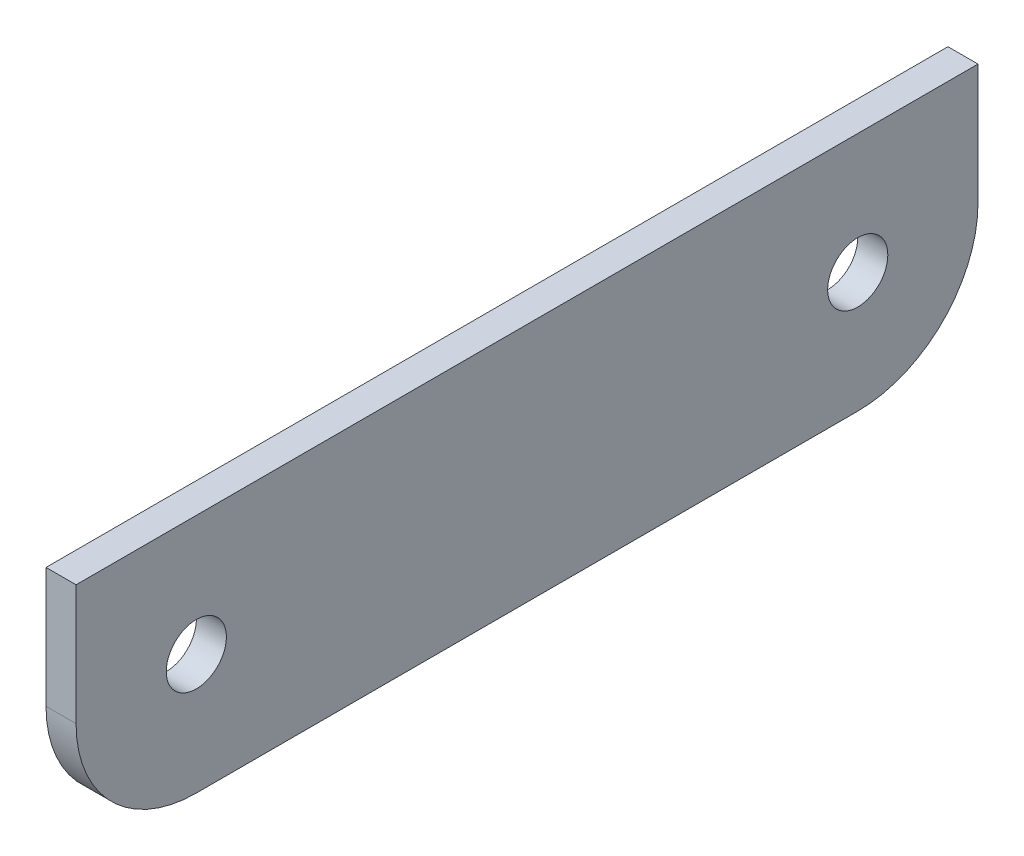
ISO-10303-21;
HEADER;
FILE_DESCRIPTION(('STEP AP214'),'2;1');
FILE_NAME('part.step','',(''),(''),'','','');
FILE_SCHEMA(('AUTOMOTIVE_DESIGN { 1 0 10303 214 1 1 1 1 }'));
ENDSEC;
DATA;
#1=APPLICATION_CONTEXT('core data for automotive mechanical design processes');
#2=APPLICATION_PROTOCOL_DEFINITION('international standard','automotive_design',2000,#1);
#3=PRODUCT_CONTEXT('',#1,'mechanical');
#4=PRODUCT('Part','Part','',(#3));
#5=PRODUCT_RELATED_PRODUCT_CATEGORY('part','',(#4));
#6=PRODUCT_DEFINITION_FORMATION('','',#4);
#7=PRODUCT_DEFINITION_CONTEXT('part definition',#1,'design');
#8=PRODUCT_DEFINITION('design','',#6,#7);
#9=PRODUCT_DEFINITION_SHAPE('','',#8);
#10=(LENGTH_UNIT() NAMED_UNIT(*) SI_UNIT(.MILLI.,.METRE.));
#11=(NAMED_UNIT(*) PLANE_ANGLE_UNIT() SI_UNIT($,.RADIAN.));
#12=(NAMED_UNIT(*) SI_UNIT($,.STERADIAN.) SOLID_ANGLE_UNIT());
#13=UNCERTAINTY_MEASURE_WITH_UNIT(LENGTH_MEASURE(1.E-05),#10,'distance_accuracy_value','');
#14=(GEOMETRIC_REPRESENTATION_CONTEXT(3) GLOBAL_UNCERTAINTY_ASSIGNED_CONTEXT((#13)) GLOBAL_UNIT_ASSIGNED_CONTEXT((#10,
#11,#12)) REPRESENTATION_CONTEXT('',''));
#15=CARTESIAN_POINT('',(0.,0.,0.));
#16=DIRECTION('',(0.,0.,1.));
#17=DIRECTION('',(1.,0.,0.));
#18=AXIS2_PLACEMENT_3D('',#15,#16,#17);
#19=CARTESIAN_POINT('',(1.,-4.,-4.));
#20=DIRECTION('',(1.,0.,0.));
#21=DIRECTION('',(0.,0.,-1.));
#22=AXIS2_PLACEMENT_3D('',#19,#20,#21);
#23=PLANE('',#22);
#24=CARTESIAN_POINT('',(1.,-4.,-26.));
#25=DIRECTION('',(1.,0.,0.));
#26=DIRECTION('',(0.,0.,-1.));
#27=AXIS2_PLACEMENT_3D('',#24,#25,#26);
#28=CIRCLE('',#27,1.);
#29=CARTESIAN_POINT('',(1.,-4.,-27.));
#30=VERTEX_POINT('',#29);
#31=EDGE_CURVE('E121',#30,#30,#28,.T.);
#32=ORIENTED_EDGE('',*,*,#31,.F.);
#33=EDGE_LOOP('',(#32));
#34=FACE_BOUND('',#33,.T.);
#35=DIRECTION('',(0.,-1.,0.));
#36=VECTOR('',#35,1.);
#37=CARTESIAN_POINT('',(1.,0.,0.));
#38=LINE('',#37,#36);
#39=CARTESIAN_POINT('',(1.,0.,0.));
#40=VERTEX_POINT('',#39);
#41=CARTESIAN_POINT('',(1.,-3.99999999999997,0.));
#42=VERTEX_POINT('',#41);
#43=EDGE_CURVE('E128',#40,#42,#38,.T.);
#44=ORIENTED_EDGE('',*,*,#43,.T.);
#45=CARTESIAN_POINT('',(1.,-4.,-4.));
#46=DIRECTION('',(1.,0.,0.));
#47=DIRECTION('',(0.,0.,-1.));
#48=AXIS2_PLACEMENT_3D('',#45,#46,#47);
#49=CIRCLE('',#48,4.);
#50=CARTESIAN_POINT('',(1.,-8.,-4.00000000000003));
#51=VERTEX_POINT('',#50);
#52=EDGE_CURVE('E86',#42,#51,#49,.T.);
#53=ORIENTED_EDGE('',*,*,#52,.T.);
#54=DIRECTION('',(0.,0.,-1.));
#55=VECTOR('',#54,1.);
#56=CARTESIAN_POINT('',(1.,-8.,-4.00000000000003));
#57=LINE('',#56,#55);
#58=CARTESIAN_POINT('',(1.,-8.,-26.));
#59=VERTEX_POINT('',#58);
#60=EDGE_CURVE('E99',#51,#59,#57,.T.);
#61=ORIENTED_EDGE('',*,*,#60,.T.);
#62=CARTESIAN_POINT('',(1.,-4.,-26.));
#63=DIRECTION('',(1.,0.,0.));
#64=DIRECTION('',(0.,0.,-1.));
#65=AXIS2_PLACEMENT_3D('',#62,#63,#64);
#66=CIRCLE('',#65,4.);
#67=CARTESIAN_POINT('',(1.,-3.99999999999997,-30.));
#68=VERTEX_POINT('',#67);
#69=EDGE_CURVE('E93',#59,#68,#66,.T.);
#70=ORIENTED_EDGE('',*,*,#69,.T.);
#71=DIRECTION('',(0.,1.,0.));
#72=VECTOR('',#71,1.);
#73=CARTESIAN_POINT('',(1.,0.,-30.));
#74=LINE('',#73,#72);
#75=CARTESIAN_POINT('',(1.,0.,-30.));
#76=VERTEX_POINT('',#75);
#77=EDGE_CURVE('E97',#68,#76,#74,.T.);
#78=ORIENTED_EDGE('',*,*,#77,.T.);
#79=DIRECTION('',(0.,0.,1.));
#80=VECTOR('',#79,1.);
#81=CARTESIAN_POINT('',(1.,0.,0.));
#82=LINE('',#81,#80);
#83=EDGE_CURVE('E49',#76,#40,#82,.T.);
#84=ORIENTED_EDGE('',*,*,#83,.T.);
#85=EDGE_LOOP('',(#44,#53,#61,#70,#78,#84));
#86=FACE_BOUND('',#85,.T.);
#87=CARTESIAN_POINT('',(1.,-4.,-4.));
#88=DIRECTION('',(1.,0.,0.));
#89=DIRECTION('',(0.,0.,1.));
#90=AXIS2_PLACEMENT_3D('',#87,#88,#89);
#91=CIRCLE('',#90,1.);
#92=CARTESIAN_POINT('',(1.,-4.,-2.99999999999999));
#93=VERTEX_POINT('',#92);
#94=EDGE_CURVE('E171',#93,#93,#91,.T.);
#95=ORIENTED_EDGE('',*,*,#94,.F.);
#96=EDGE_LOOP('',(#95));
#97=FACE_BOUND('',#96,.T.);
#98=ADVANCED_FACE('F32',(#34,#86,#97),#23,.T.);
#99=CARTESIAN_POINT('',(0.,-4.,-4.));
#100=DIRECTION('',(1.,0.,0.));
#101=DIRECTION('',(0.,0.,-1.));
#102=AXIS2_PLACEMENT_3D('',#99,#100,#101);
#103=PLANE('',#102);
#104=CARTESIAN_POINT('',(0.,-4.,-26.));
#105=DIRECTION('',(1.,0.,0.));
#106=DIRECTION('',(0.,0.,-1.));
#107=AXIS2_PLACEMENT_3D('',#104,#105,#106);
#108=CIRCLE('',#107,1.);
#109=CARTESIAN_POINT('',(0.,-4.,-27.));
#110=VERTEX_POINT('',#109);
#111=EDGE_CURVE('E176',#110,#110,#108,.T.);
#112=ORIENTED_EDGE('',*,*,#111,.T.);
#113=EDGE_LOOP('',(#112));
#114=FACE_BOUND('',#113,.T.);
#115=DIRECTION('',(0.,-1.,0.));
#116=VECTOR('',#115,1.);
#117=CARTESIAN_POINT('',(0.,0.,0.));
#118=LINE('',#117,#116);
#119=CARTESIAN_POINT('',(0.,0.,0.));
#120=VERTEX_POINT('',#119);
#121=CARTESIAN_POINT('',(0.,-3.99999999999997,0.));
#122=VERTEX_POINT('',#121);
#123=EDGE_CURVE('E117',#120,#122,#118,.T.);
#124=ORIENTED_EDGE('',*,*,#123,.F.);
#125=DIRECTION('',(0.,0.,1.));
#126=VECTOR('',#125,1.);
#127=CARTESIAN_POINT('',(0.,0.,0.));
#128=LINE('',#127,#126);
#129=CARTESIAN_POINT('',(0.,0.,-30.));
#130=VERTEX_POINT('',#129);
#131=EDGE_CURVE('E78',#130,#120,#128,.T.);
#132=ORIENTED_EDGE('',*,*,#131,.F.);
#133=DIRECTION('',(0.,1.,0.));
#134=VECTOR('',#133,1.);
#135=CARTESIAN_POINT('',(0.,0.,-30.));
#136=LINE('',#135,#134);
#137=CARTESIAN_POINT('',(0.,-3.99999999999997,-30.));
#138=VERTEX_POINT('',#137);
#139=EDGE_CURVE('E72',#138,#130,#136,.T.);
#140=ORIENTED_EDGE('',*,*,#139,.F.);
#141=CARTESIAN_POINT('',(0.,-4.,-26.));
#142=DIRECTION('',(1.,0.,0.));
#143=DIRECTION('',(0.,0.,-1.));
#144=AXIS2_PLACEMENT_3D('',#141,#142,#143);
#145=CIRCLE('',#144,4.);
#146=CARTESIAN_POINT('',(0.,-8.,-26.));
#147=VERTEX_POINT('',#146);
#148=EDGE_CURVE('E107',#147,#138,#145,.T.);
#149=ORIENTED_EDGE('',*,*,#148,.F.);
#150=DIRECTION('',(0.,0.,-1.));
#151=VECTOR('',#150,1.);
#152=CARTESIAN_POINT('',(0.,-8.,-4.00000000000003));
#153=LINE('',#152,#151);
#154=CARTESIAN_POINT('',(0.,-8.,-4.00000000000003));
#155=VERTEX_POINT('',#154);
#156=EDGE_CURVE('E123',#155,#147,#153,.T.);
#157=ORIENTED_EDGE('',*,*,#156,.F.);
#158=CARTESIAN_POINT('',(0.,-4.,-4.));
#159=DIRECTION('',(1.,0.,0.));
#160=DIRECTION('',(0.,0.,-1.));
#161=AXIS2_PLACEMENT_3D('',#158,#159,#160);
#162=CIRCLE('',#161,4.);
#163=EDGE_CURVE('E120',#122,#155,#162,.T.);
#164=ORIENTED_EDGE('',*,*,#163,.F.);
#165=EDGE_LOOP('',(#124,#132,#140,#149,#157,#164));
#166=FACE_BOUND('',#165,.T.);
#167=CARTESIAN_POINT('',(0.,-4.,-4.));
#168=DIRECTION('',(1.,0.,0.));
#169=DIRECTION('',(0.,0.,1.));
#170=AXIS2_PLACEMENT_3D('',#167,#168,#169);
#171=CIRCLE('',#170,1.);
#172=CARTESIAN_POINT('',(0.,-4.,-2.99999999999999));
#173=VERTEX_POINT('',#172);
#174=EDGE_CURVE('E174',#173,#173,#171,.T.);
#175=ORIENTED_EDGE('',*,*,#174,.T.);
#176=EDGE_LOOP('',(#175));
#177=FACE_BOUND('',#176,.T.);
#178=ADVANCED_FACE('F137',(#114,#166,#177),#103,.F.);
#179=CARTESIAN_POINT('',(1.,0.,0.));
#180=DIRECTION('',(0.,0.,-1.));
#181=DIRECTION('',(-1.,0.,0.));
#182=AXIS2_PLACEMENT_3D('',#179,#180,#181);
#183=PLANE('',#182);
#184=ORIENTED_EDGE('',*,*,#123,.T.);
#185=DIRECTION('',(-1.,0.,0.));
#186=VECTOR('',#185,1.);
#187=CARTESIAN_POINT('',(1.,-3.99999999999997,0.));
#188=LINE('',#187,#186);
#189=EDGE_CURVE('E11',#42,#122,#188,.T.);
#190=ORIENTED_EDGE('',*,*,#189,.F.);
#191=ORIENTED_EDGE('',*,*,#43,.F.);
#192=DIRECTION('',(-1.,0.,0.));
#193=VECTOR('',#192,1.);
#194=CARTESIAN_POINT('',(1.,0.,0.));
#195=LINE('',#194,#193);
#196=EDGE_CURVE('E113',#40,#120,#195,.T.);
#197=ORIENTED_EDGE('',*,*,#196,.T.);
#198=EDGE_LOOP('',(#184,#190,#191,#197));
#199=FACE_BOUND('',#198,.T.);
#200=ADVANCED_FACE('F34',(#199),#183,.F.);
#201=CARTESIAN_POINT('',(1.,-4.,-4.));
#202=DIRECTION('',(-1.,0.,0.));
#203=DIRECTION('',(0.,0.,1.));
#204=AXIS2_PLACEMENT_3D('',#201,#202,#203);
#205=CYLINDRICAL_SURFACE('',#204,4.);
#206=ORIENTED_EDGE('',*,*,#163,.T.);
#207=DIRECTION('',(-1.,0.,0.));
#208=VECTOR('',#207,1.);
#209=CARTESIAN_POINT('',(1.,-8.,-4.00000000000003));
#210=LINE('',#209,#208);
#211=EDGE_CURVE('E41',#51,#155,#210,.T.);
#212=ORIENTED_EDGE('',*,*,#211,.F.);
#213=ORIENTED_EDGE('',*,*,#52,.F.);
#214=ORIENTED_EDGE('',*,*,#189,.T.);
#215=EDGE_LOOP('',(#206,#212,#213,#214));
#216=FACE_BOUND('',#215,.T.);
#217=ADVANCED_FACE('F217',(#216),#205,.T.);
#218=CARTESIAN_POINT('',(1.,-8.,-4.00000000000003));
#219=DIRECTION('',(0.,1.,0.));
#220=DIRECTION('',(0.,0.,1.));
#221=AXIS2_PLACEMENT_3D('',#218,#219,#220);
#222=PLANE('',#221);
#223=ORIENTED_EDGE('',*,*,#156,.T.);
#224=DIRECTION('',(-1.,0.,0.));
#225=VECTOR('',#224,1.);
#226=CARTESIAN_POINT('',(1.,-8.,-26.));
#227=LINE('',#226,#225);
#228=EDGE_CURVE('E108',#59,#147,#227,.T.);
#229=ORIENTED_EDGE('',*,*,#228,.F.);
#230=ORIENTED_EDGE('',*,*,#60,.F.);
#231=ORIENTED_EDGE('',*,*,#211,.T.);
#232=EDGE_LOOP('',(#223,#229,#230,#231));
#233=FACE_BOUND('',#232,.T.);
#234=ADVANCED_FACE('F134',(#233),#222,.F.);
#235=CARTESIAN_POINT('',(1.,-4.,-26.));
#236=DIRECTION('',(-1.,0.,0.));
#237=DIRECTION('',(0.,0.,1.));
#238=AXIS2_PLACEMENT_3D('',#235,#236,#237);
#239=CYLINDRICAL_SURFACE('',#238,4.);
#240=ORIENTED_EDGE('',*,*,#148,.T.);
#241=DIRECTION('',(-1.,0.,0.));
#242=VECTOR('',#241,1.);
#243=CARTESIAN_POINT('',(1.,-3.99999999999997,-30.));
#244=LINE('',#243,#242);
#245=EDGE_CURVE('E104',#68,#138,#244,.T.);
#246=ORIENTED_EDGE('',*,*,#245,.F.);
#247=ORIENTED_EDGE('',*,*,#69,.F.);
#248=ORIENTED_EDGE('',*,*,#228,.T.);
#249=EDGE_LOOP('',(#240,#246,#247,#248));
#250=FACE_BOUND('',#249,.T.);
#251=ADVANCED_FACE('F105',(#250),#239,.T.);
#252=CARTESIAN_POINT('',(1.,0.,-30.));
#253=DIRECTION('',(0.,0.,1.));
#254=DIRECTION('',(1.,0.,0.));
#255=AXIS2_PLACEMENT_3D('',#252,#253,#254);
#256=PLANE('',#255);
#257=ORIENTED_EDGE('',*,*,#139,.T.);
#258=DIRECTION('',(-1.,0.,0.));
#259=VECTOR('',#258,1.);
#260=CARTESIAN_POINT('',(1.,0.,-30.));
#261=LINE('',#260,#259);
#262=EDGE_CURVE('E109',#76,#130,#261,.T.);
#263=ORIENTED_EDGE('',*,*,#262,.F.);
#264=ORIENTED_EDGE('',*,*,#77,.F.);
#265=ORIENTED_EDGE('',*,*,#245,.T.);
#266=EDGE_LOOP('',(#257,#263,#264,#265));
#267=FACE_BOUND('',#266,.T.);
#268=ADVANCED_FACE('F111',(#267),#256,.F.);
#269=CARTESIAN_POINT('',(1.,0.,0.));
#270=DIRECTION('',(0.,-1.,0.));
#271=DIRECTION('',(0.,0.,-1.));
#272=AXIS2_PLACEMENT_3D('',#269,#270,#271);
#273=PLANE('',#272);
#274=ORIENTED_EDGE('',*,*,#131,.T.);
#275=ORIENTED_EDGE('',*,*,#196,.F.);
#276=ORIENTED_EDGE('',*,*,#83,.F.);
#277=ORIENTED_EDGE('',*,*,#262,.T.);
#278=EDGE_LOOP('',(#274,#275,#276,#277));
#279=FACE_BOUND('',#278,.T.);
#280=ADVANCED_FACE('F142',(#279),#273,.F.);
#281=CARTESIAN_POINT('',(1.,-4.,-26.));
#282=DIRECTION('',(-1.,0.,0.));
#283=DIRECTION('',(0.,0.,1.));
#284=AXIS2_PLACEMENT_3D('',#281,#282,#283);
#285=CYLINDRICAL_SURFACE('',#284,1.);
#286=ORIENTED_EDGE('',*,*,#31,.T.);
#287=EDGE_LOOP('',(#286));
#288=FACE_BOUND('',#287,.T.);
#289=ORIENTED_EDGE('',*,*,#111,.F.);
#290=EDGE_LOOP('',(#289));
#291=FACE_BOUND('',#290,.T.);
#292=ADVANCED_FACE('F144',(#288,#291),#285,.F.);
#293=CARTESIAN_POINT('',(1.,-4.,-4.));
#294=DIRECTION('',(-1.,0.,0.));
#295=DIRECTION('',(0.,0.,1.));
#296=AXIS2_PLACEMENT_3D('',#293,#294,#295);
#297=CYLINDRICAL_SURFACE('',#296,1.);
#298=ORIENTED_EDGE('',*,*,#94,.T.);
#299=EDGE_LOOP('',(#298));
#300=FACE_BOUND('',#299,.T.);
#301=ORIENTED_EDGE('',*,*,#174,.F.);
#302=EDGE_LOOP('',(#301));
#303=FACE_BOUND('',#302,.T.);
#304=ADVANCED_FACE('F150',(#300,#303),#297,.F.);
#305=CLOSED_SHELL('',(#98,#178,#200,#217,#234,#251,#268,#280,#292,#304));
#306=MANIFOLD_SOLID_BREP('B2',#305);
#307=ADVANCED_BREP_SHAPE_REPRESENTATION('',(#18,#306),#14);
#308=SHAPE_DEFINITION_REPRESENTATION(#9,#307);
ENDSEC;
END-ISO-10303-21;
